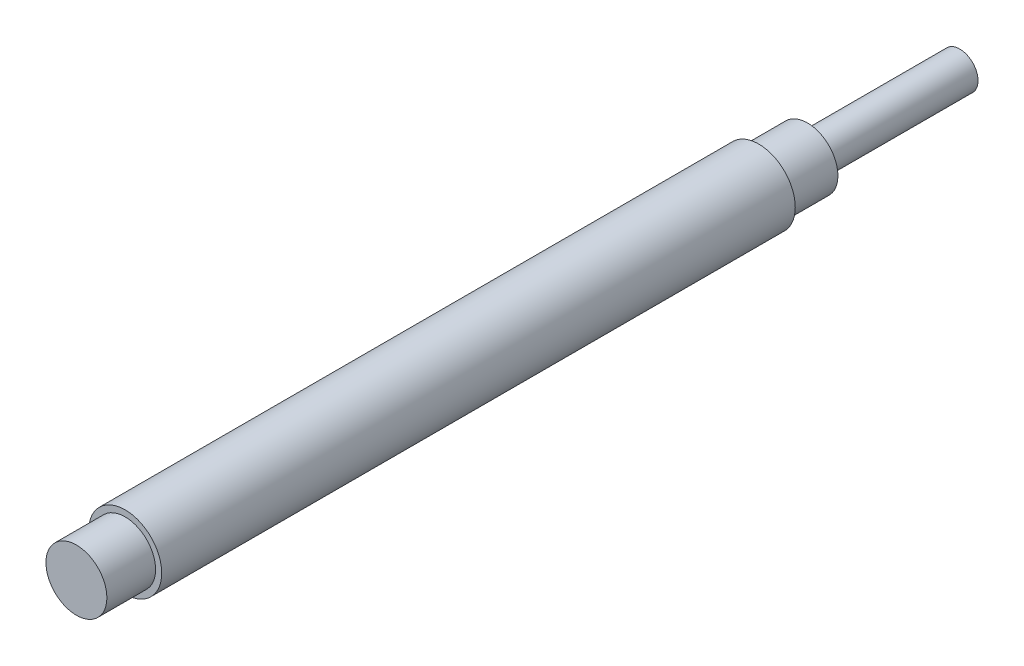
from build123d import *

# Parameters (mm, degrees)
ESBO_O1_R                = 3
RESSALTO_EXTRUS_O1_DEPTH = 72.5
CORTE_EXTRUS_O1_START    = -4
ESBO_O2_R                = 3
ESBO_O2_R_2              = 2.5
CORTE_EXTRUS_O1_DEPTH    = 4
ESBO_O3_R                = 3
ESBO_O3_R_2              = 2.5
CORTE_EXTRUS_O2_DEPTH    = 16.5
ESBO_O4_R                = 2.5
ESBO_O4_R_2              = 1.5
CORTE_EXTRUS_O3_DEPTH    = 12.5


with BuildPart() as part:
    # Esbo_o1 → Ressalto-extrus_o1 (new body)
    with BuildSketch(Plane.XY):
        Circle(ESBO_O1_R)
    extrude(amount=RESSALTO_EXTRUS_O1_DEPTH)

    # Esbo_o2 → Corte-extrus_o1 (cut)
    with BuildSketch(Plane.XY.offset(72.5).offset(CORTE_EXTRUS_O1_START)):
        Circle(ESBO_O2_R)
        Circle(ESBO_O2_R_2, mode=Mode.SUBTRACT)
    extrude(amount=CORTE_EXTRUS_O1_DEPTH, mode=Mode.SUBTRACT)

    # Esbo_o3 → Corte-extrus_o2 (cut)
    with BuildSketch(Plane(origin=(0, 0, 0), x_dir=(-1, 0, 0), z_dir=(0, 0, -1))):
        with Locations(Location((0, 0, 0), (0, 0, 180))):
            Circle(ESBO_O3_R)
        with Locations(Location((0, 0, 0), (0, 0, 180))):
            Circle(ESBO_O3_R_2, mode=Mode.SUBTRACT)
    extrude(amount=-CORTE_EXTRUS_O2_DEPTH, mode=Mode.SUBTRACT)

    # Esbo_o4 → Corte-extrus_o3 (cut)
    with BuildSketch(Plane(origin=(0, 0, 0), x_dir=(-1, 0, 0), z_dir=(0, 0, -1))):
        with Locations(Location((0, 0, 0), (0, 0, 180))):
            Circle(ESBO_O4_R)
        Circle(ESBO_O4_R_2, mode=Mode.SUBTRACT)
    extrude(amount=-CORTE_EXTRUS_O3_DEPTH, mode=Mode.SUBTRACT)


solid = part.part
